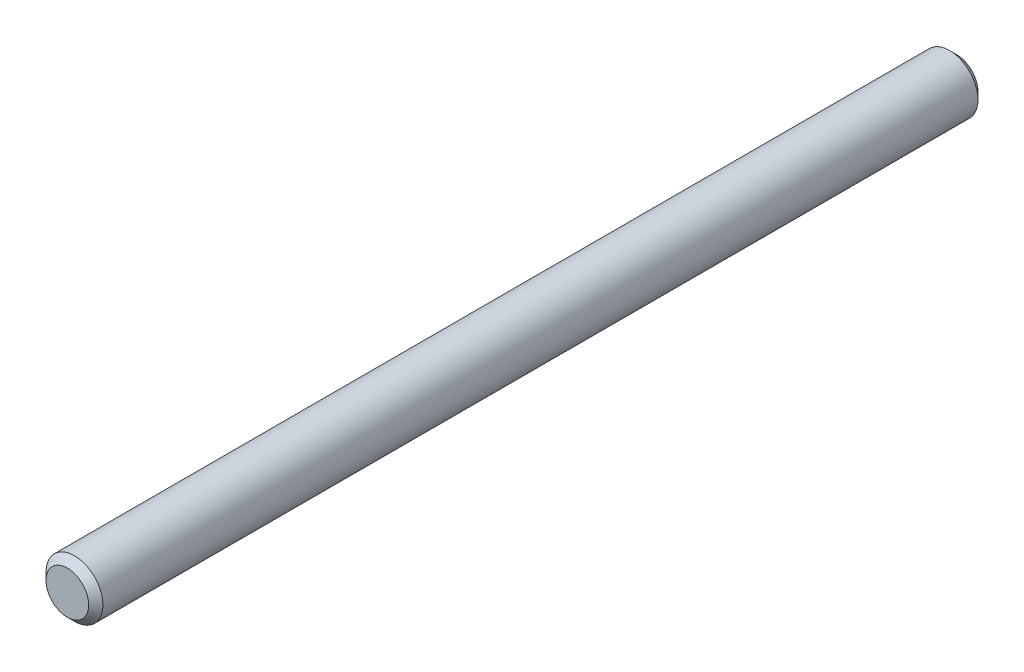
ISO-10303-21;
HEADER;
FILE_DESCRIPTION(('STEP AP214'),'2;1');
FILE_NAME('part.step','',(''),(''),'','','');
FILE_SCHEMA(('AUTOMOTIVE_DESIGN { 1 0 10303 214 1 1 1 1 }'));
ENDSEC;
DATA;
#1=APPLICATION_CONTEXT('core data for automotive mechanical design processes');
#2=APPLICATION_PROTOCOL_DEFINITION('international standard','automotive_design',2000,#1);
#3=PRODUCT_CONTEXT('',#1,'mechanical');
#4=PRODUCT('Part','Part','',(#3));
#5=PRODUCT_RELATED_PRODUCT_CATEGORY('part','',(#4));
#6=PRODUCT_DEFINITION_FORMATION('','',#4);
#7=PRODUCT_DEFINITION_CONTEXT('part definition',#1,'design');
#8=PRODUCT_DEFINITION('design','',#6,#7);
#9=PRODUCT_DEFINITION_SHAPE('','',#8);
#10=(LENGTH_UNIT() NAMED_UNIT(*) SI_UNIT(.MILLI.,.METRE.));
#11=(NAMED_UNIT(*) PLANE_ANGLE_UNIT() SI_UNIT($,.RADIAN.));
#12=(NAMED_UNIT(*) SI_UNIT($,.STERADIAN.) SOLID_ANGLE_UNIT());
#13=UNCERTAINTY_MEASURE_WITH_UNIT(LENGTH_MEASURE(1.E-05),#10,'distance_accuracy_value','');
#14=(GEOMETRIC_REPRESENTATION_CONTEXT(3) GLOBAL_UNCERTAINTY_ASSIGNED_CONTEXT((#13)) GLOBAL_UNIT_ASSIGNED_CONTEXT((#10,
#11,#12)) REPRESENTATION_CONTEXT('',''));
#15=CARTESIAN_POINT('',(0.,0.,0.));
#16=DIRECTION('',(0.,0.,1.));
#17=DIRECTION('',(1.,0.,0.));
#18=AXIS2_PLACEMENT_3D('',#15,#16,#17);
#19=CARTESIAN_POINT('',(0.,0.,250.));
#20=DIRECTION('',(0.,0.,-1.));
#21=DIRECTION('',(-1.,0.,0.));
#22=AXIS2_PLACEMENT_3D('',#19,#20,#21);
#23=CYLINDRICAL_SURFACE('',#22,8.);
#24=CARTESIAN_POINT('',(0.,0.,2.));
#25=DIRECTION('',(0.,0.,1.));
#26=DIRECTION('',(1.,0.,0.));
#27=AXIS2_PLACEMENT_3D('',#24,#25,#26);
#28=CIRCLE('',#27,8.);
#29=CARTESIAN_POINT('',(8.,0.,2.));
#30=VERTEX_POINT('',#29);
#31=EDGE_CURVE('E45',#30,#30,#28,.T.);
#32=ORIENTED_EDGE('',*,*,#31,.T.);
#33=EDGE_LOOP('',(#32));
#34=FACE_BOUND('',#33,.T.);
#35=CARTESIAN_POINT('',(0.,0.,248.));
#36=DIRECTION('',(0.,0.,1.));
#37=DIRECTION('',(1.,0.,0.));
#38=AXIS2_PLACEMENT_3D('',#35,#36,#37);
#39=CIRCLE('',#38,8.);
#40=CARTESIAN_POINT('',(8.,0.,248.));
#41=VERTEX_POINT('',#40);
#42=EDGE_CURVE('E49',#41,#41,#39,.F.);
#43=ORIENTED_EDGE('',*,*,#42,.T.);
#44=EDGE_LOOP('',(#43));
#45=FACE_BOUND('',#44,.T.);
#46=ADVANCED_FACE('F34',(#34,#45),#23,.T.);
#47=CARTESIAN_POINT('',(0.,0.,250.));
#48=DIRECTION('',(0.,0.,1.));
#49=DIRECTION('',(1.,0.,0.));
#50=AXIS2_PLACEMENT_3D('',#47,#48,#49);
#51=PLANE('',#50);
#52=CARTESIAN_POINT('',(0.,0.,250.));
#53=DIRECTION('',(0.,0.,1.));
#54=DIRECTION('',(1.,0.,0.));
#55=AXIS2_PLACEMENT_3D('',#52,#53,#54);
#56=CIRCLE('',#55,6.);
#57=CARTESIAN_POINT('',(6.,0.,250.));
#58=VERTEX_POINT('',#57);
#59=EDGE_CURVE('E10',#58,#58,#56,.T.);
#60=ORIENTED_EDGE('',*,*,#59,.T.);
#61=EDGE_LOOP('',(#60));
#62=FACE_BOUND('',#61,.T.);
#63=ADVANCED_FACE('F65',(#62),#51,.T.);
#64=CARTESIAN_POINT('',(0.,0.,0.));
#65=DIRECTION('',(0.,0.,1.));
#66=DIRECTION('',(1.,0.,0.));
#67=AXIS2_PLACEMENT_3D('',#64,#65,#66);
#68=PLANE('',#67);
#69=CARTESIAN_POINT('',(0.,0.,0.));
#70=DIRECTION('',(0.,0.,1.));
#71=DIRECTION('',(1.,0.,0.));
#72=AXIS2_PLACEMENT_3D('',#69,#70,#71);
#73=CIRCLE('',#72,6.);
#74=CARTESIAN_POINT('',(6.,0.,0.));
#75=VERTEX_POINT('',#74);
#76=EDGE_CURVE('E41',#75,#75,#73,.F.);
#77=ORIENTED_EDGE('',*,*,#76,.T.);
#78=EDGE_LOOP('',(#77));
#79=FACE_BOUND('',#78,.T.);
#80=ADVANCED_FACE('F62',(#79),#68,.F.);
#81=CARTESIAN_POINT('',(0.,0.,2.));
#82=DIRECTION('',(0.,0.,1.));
#83=DIRECTION('',(1.,0.,0.));
#84=AXIS2_PLACEMENT_3D('',#81,#82,#83);
#85=CONICAL_SURFACE('',#84,8.,0.785398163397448);
#86=ORIENTED_EDGE('',*,*,#76,.F.);
#87=EDGE_LOOP('',(#86));
#88=FACE_BOUND('',#87,.T.);
#89=ORIENTED_EDGE('',*,*,#31,.F.);
#90=EDGE_LOOP('',(#89));
#91=FACE_BOUND('',#90,.T.);
#92=ADVANCED_FACE('F58',(#88,#91),#85,.T.);
#93=CARTESIAN_POINT('',(0.,0.,250.));
#94=DIRECTION('',(0.,0.,-1.));
#95=DIRECTION('',(-1.,0.,0.));
#96=AXIS2_PLACEMENT_3D('',#93,#94,#95);
#97=CONICAL_SURFACE('',#96,6.,0.785398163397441);
#98=ORIENTED_EDGE('',*,*,#42,.F.);
#99=EDGE_LOOP('',(#98));
#100=FACE_BOUND('',#99,.T.);
#101=ORIENTED_EDGE('',*,*,#59,.F.);
#102=EDGE_LOOP('',(#101));
#103=FACE_BOUND('',#102,.T.);
#104=ADVANCED_FACE('F36',(#100,#103),#97,.T.);
#105=CLOSED_SHELL('',(#46,#63,#80,#92,#104));
#106=MANIFOLD_SOLID_BREP('B2',#105);
#107=ADVANCED_BREP_SHAPE_REPRESENTATION('',(#18,#106),#14);
#108=SHAPE_DEFINITION_REPRESENTATION(#9,#107);
ENDSEC;
END-ISO-10303-21;
